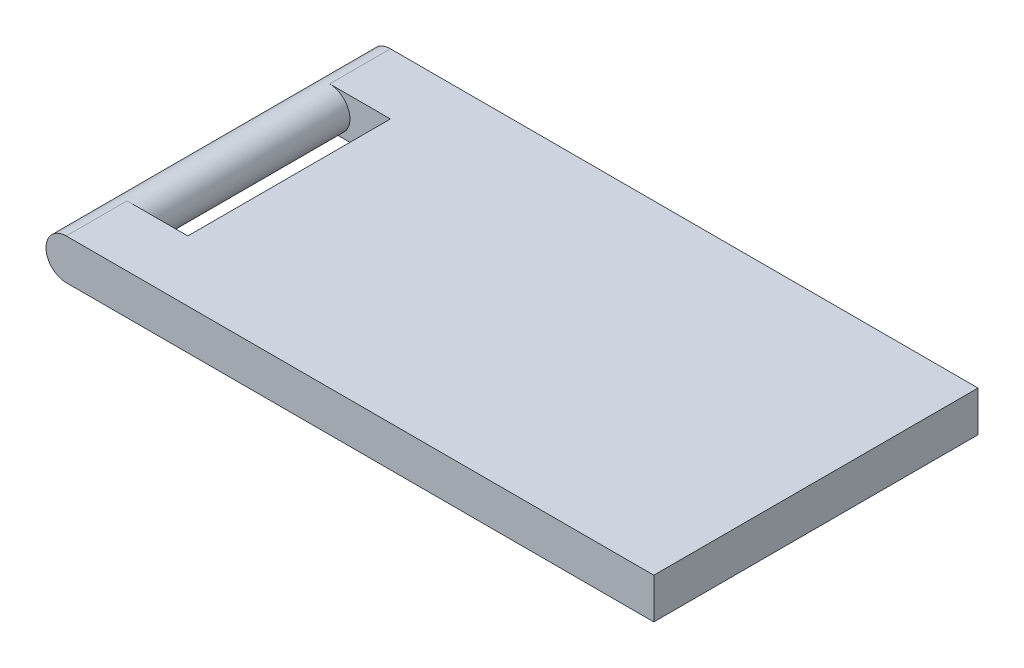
ISO-10303-21;
HEADER;
FILE_DESCRIPTION(('STEP AP214'),'2;1');
FILE_NAME('part.step','',(''),(''),'','','');
FILE_SCHEMA(('AUTOMOTIVE_DESIGN { 1 0 10303 214 1 1 1 1 }'));
ENDSEC;
DATA;
#1=APPLICATION_CONTEXT('core data for automotive mechanical design processes');
#2=APPLICATION_PROTOCOL_DEFINITION('international standard','automotive_design',2000,#1);
#3=PRODUCT_CONTEXT('',#1,'mechanical');
#4=PRODUCT('Part','Part','',(#3));
#5=PRODUCT_RELATED_PRODUCT_CATEGORY('part','',(#4));
#6=PRODUCT_DEFINITION_FORMATION('','',#4);
#7=PRODUCT_DEFINITION_CONTEXT('part definition',#1,'design');
#8=PRODUCT_DEFINITION('design','',#6,#7);
#9=PRODUCT_DEFINITION_SHAPE('','',#8);
#10=(LENGTH_UNIT() NAMED_UNIT(*) SI_UNIT(.MILLI.,.METRE.));
#11=(NAMED_UNIT(*) PLANE_ANGLE_UNIT() SI_UNIT($,.RADIAN.));
#12=(NAMED_UNIT(*) SI_UNIT($,.STERADIAN.) SOLID_ANGLE_UNIT());
#13=UNCERTAINTY_MEASURE_WITH_UNIT(LENGTH_MEASURE(1.E-05),#10,'distance_accuracy_value','');
#14=(GEOMETRIC_REPRESENTATION_CONTEXT(3) GLOBAL_UNCERTAINTY_ASSIGNED_CONTEXT((#13)) GLOBAL_UNIT_ASSIGNED_CONTEXT((#10,
#11,#12)) REPRESENTATION_CONTEXT('',''));
#15=CARTESIAN_POINT('',(0.,0.,0.));
#16=DIRECTION('',(0.,0.,1.));
#17=DIRECTION('',(1.,0.,0.));
#18=AXIS2_PLACEMENT_3D('',#15,#16,#17);
#19=CARTESIAN_POINT('',(0.,10.,-25.));
#20=DIRECTION('',(0.,0.,-1.));
#21=DIRECTION('',(-1.,0.,0.));
#22=AXIS2_PLACEMENT_3D('',#19,#20,#21);
#23=PLANE('',#22);
#24=CARTESIAN_POINT('',(5.00000000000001,5.,-25.));
#25=DIRECTION('',(0.,0.,1.));
#26=DIRECTION('',(1.,0.,0.));
#27=AXIS2_PLACEMENT_3D('',#24,#25,#26);
#28=CIRCLE('',#27,5.);
#29=CARTESIAN_POINT('',(5.00000000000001,0.,-25.));
#30=VERTEX_POINT('',#29);
#31=CARTESIAN_POINT('',(5.,10.,-25.));
#32=VERTEX_POINT('',#31);
#33=EDGE_CURVE('E105',#30,#32,#28,.T.);
#34=ORIENTED_EDGE('',*,*,#33,.F.);
#35=DIRECTION('',(1.,0.,0.));
#36=VECTOR('',#35,1.);
#37=CARTESIAN_POINT('',(0.,0.,-25.));
#38=LINE('',#37,#36);
#39=CARTESIAN_POINT('',(20.,0.,-25.));
#40=VERTEX_POINT('',#39);
#41=EDGE_CURVE('E92',#30,#40,#38,.T.);
#42=ORIENTED_EDGE('',*,*,#41,.T.);
#43=DIRECTION('',(0.,-1.,0.));
#44=VECTOR('',#43,1.);
#45=CARTESIAN_POINT('',(20.,10.,-25.));
#46=LINE('',#45,#44);
#47=CARTESIAN_POINT('',(20.,10.,-25.));
#48=VERTEX_POINT('',#47);
#49=EDGE_CURVE('E151',#48,#40,#46,.T.);
#50=ORIENTED_EDGE('',*,*,#49,.F.);
#51=DIRECTION('',(1.,0.,0.));
#52=VECTOR('',#51,1.);
#53=CARTESIAN_POINT('',(0.,10.,-25.));
#54=LINE('',#53,#52);
#55=EDGE_CURVE('E114',#32,#48,#54,.T.);
#56=ORIENTED_EDGE('',*,*,#55,.F.);
#57=EDGE_LOOP('',(#34,#42,#50,#56));
#58=FACE_BOUND('',#57,.T.);
#59=ADVANCED_FACE('F30',(#58),#23,.F.);
#60=CARTESIAN_POINT('',(0.,10.,25.));
#61=DIRECTION('',(0.,0.,1.));
#62=DIRECTION('',(1.,0.,0.));
#63=AXIS2_PLACEMENT_3D('',#60,#61,#62);
#64=PLANE('',#63);
#65=CARTESIAN_POINT('',(5.00000000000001,5.,25.));
#66=DIRECTION('',(0.,0.,1.));
#67=DIRECTION('',(1.,0.,0.));
#68=AXIS2_PLACEMENT_3D('',#65,#66,#67);
#69=CIRCLE('',#68,5.);
#70=CARTESIAN_POINT('',(5.00000000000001,10.,25.));
#71=VERTEX_POINT('',#70);
#72=CARTESIAN_POINT('',(5.00000000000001,0.,25.));
#73=VERTEX_POINT('',#72);
#74=EDGE_CURVE('E115',#71,#73,#69,.F.);
#75=ORIENTED_EDGE('',*,*,#74,.F.);
#76=DIRECTION('',(-1.,0.,0.));
#77=VECTOR('',#76,1.);
#78=CARTESIAN_POINT('',(0.,10.,25.));
#79=LINE('',#78,#77);
#80=CARTESIAN_POINT('',(20.,10.,25.));
#81=VERTEX_POINT('',#80);
#82=EDGE_CURVE('E124',#81,#71,#79,.T.);
#83=ORIENTED_EDGE('',*,*,#82,.F.);
#84=DIRECTION('',(0.,-1.,0.));
#85=VECTOR('',#84,1.);
#86=CARTESIAN_POINT('',(20.,10.,25.));
#87=LINE('',#86,#85);
#88=CARTESIAN_POINT('',(20.,0.,25.));
#89=VERTEX_POINT('',#88);
#90=EDGE_CURVE('E148',#81,#89,#87,.T.);
#91=ORIENTED_EDGE('',*,*,#90,.T.);
#92=DIRECTION('',(-1.,0.,0.));
#93=VECTOR('',#92,1.);
#94=CARTESIAN_POINT('',(0.,0.,25.));
#95=LINE('',#94,#93);
#96=EDGE_CURVE('E136',#89,#73,#95,.T.);
#97=ORIENTED_EDGE('',*,*,#96,.T.);
#98=EDGE_LOOP('',(#75,#83,#91,#97));
#99=FACE_BOUND('',#98,.T.);
#100=ADVANCED_FACE('F160',(#99),#64,.F.);
#101=CARTESIAN_POINT('',(5.,5.,-40.));
#102=DIRECTION('',(0.,0.,1.));
#103=DIRECTION('',(1.,0.,0.));
#104=AXIS2_PLACEMENT_3D('',#101,#102,#103);
#105=CYLINDRICAL_SURFACE('',#104,5.);
#106=DIRECTION('',(0.,0.,-1.));
#107=VECTOR('',#106,1.);
#108=CARTESIAN_POINT('',(5.,10.,-40.));
#109=LINE('',#108,#107);
#110=CARTESIAN_POINT('',(5.,10.,-40.));
#111=VERTEX_POINT('',#110);
#112=EDGE_CURVE('E111',#111,#32,#109,.F.);
#113=ORIENTED_EDGE('',*,*,#112,.F.);
#114=CARTESIAN_POINT('',(5.,5.,-40.));
#115=DIRECTION('',(0.,0.,1.));
#116=DIRECTION('',(1.,0.,0.));
#117=AXIS2_PLACEMENT_3D('',#114,#115,#116);
#118=CIRCLE('',#117,5.);
#119=CARTESIAN_POINT('',(5.,0.,-40.));
#120=VERTEX_POINT('',#119);
#121=EDGE_CURVE('E110',#120,#111,#118,.F.);
#122=ORIENTED_EDGE('',*,*,#121,.F.);
#123=DIRECTION('',(0.,0.,1.));
#124=VECTOR('',#123,1.);
#125=CARTESIAN_POINT('',(5.00000000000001,0.,-25.));
#126=LINE('',#125,#124);
#127=EDGE_CURVE('E97',#30,#120,#126,.F.);
#128=ORIENTED_EDGE('',*,*,#127,.F.);
#129=ORIENTED_EDGE('',*,*,#33,.T.);
#130=EDGE_LOOP('',(#113,#122,#128,#129));
#131=FACE_BOUND('',#130,.T.);
#132=DIRECTION('',(0.,0.,-1.));
#133=VECTOR('',#132,1.);
#134=CARTESIAN_POINT('',(5.00000000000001,10.,25.));
#135=LINE('',#134,#133);
#136=CARTESIAN_POINT('',(5.00000000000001,10.,40.));
#137=VERTEX_POINT('',#136);
#138=EDGE_CURVE('E155',#71,#137,#135,.F.);
#139=ORIENTED_EDGE('',*,*,#138,.F.);
#140=ORIENTED_EDGE('',*,*,#74,.T.);
#141=DIRECTION('',(0.,0.,1.));
#142=VECTOR('',#141,1.);
#143=CARTESIAN_POINT('',(5.,0.,-25.));
#144=LINE('',#143,#142);
#145=CARTESIAN_POINT('',(5.00000000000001,0.,40.));
#146=VERTEX_POINT('',#145);
#147=EDGE_CURVE('E38',#146,#73,#144,.F.);
#148=ORIENTED_EDGE('',*,*,#147,.F.);
#149=CARTESIAN_POINT('',(5.00000000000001,5.,40.));
#150=DIRECTION('',(0.,0.,-1.));
#151=DIRECTION('',(-1.,0.,0.));
#152=AXIS2_PLACEMENT_3D('',#149,#150,#151);
#153=CIRCLE('',#152,5.);
#154=EDGE_CURVE('E11',#137,#146,#153,.F.);
#155=ORIENTED_EDGE('',*,*,#154,.F.);
#156=EDGE_LOOP('',(#139,#140,#148,#155));
#157=FACE_BOUND('',#156,.T.);
#158=ADVANCED_FACE('F32',(#131,#157),#105,.T.);
#159=CARTESIAN_POINT('',(20.,10.,-25.));
#160=DIRECTION('',(1.,0.,0.));
#161=DIRECTION('',(0.,0.,-1.));
#162=AXIS2_PLACEMENT_3D('',#159,#160,#161);
#163=PLANE('',#162);
#164=DIRECTION('',(0.,0.,1.));
#165=VECTOR('',#164,1.);
#166=CARTESIAN_POINT('',(20.,0.,-25.));
#167=LINE('',#166,#165);
#168=EDGE_CURVE('E100',#40,#89,#167,.T.);
#169=ORIENTED_EDGE('',*,*,#168,.T.);
#170=ORIENTED_EDGE('',*,*,#90,.F.);
#171=DIRECTION('',(0.,0.,1.));
#172=VECTOR('',#171,1.);
#173=CARTESIAN_POINT('',(20.,10.,-25.));
#174=LINE('',#173,#172);
#175=EDGE_CURVE('E121',#48,#81,#174,.T.);
#176=ORIENTED_EDGE('',*,*,#175,.F.);
#177=ORIENTED_EDGE('',*,*,#49,.T.);
#178=EDGE_LOOP('',(#169,#170,#176,#177));
#179=FACE_BOUND('',#178,.T.);
#180=ADVANCED_FACE('F164',(#179),#163,.F.);
#181=CARTESIAN_POINT('',(0.,10.,40.));
#182=DIRECTION('',(0.,0.,-1.));
#183=DIRECTION('',(-1.,0.,0.));
#184=AXIS2_PLACEMENT_3D('',#181,#182,#183);
#185=PLANE('',#184);
#186=DIRECTION('',(1.,0.,0.));
#187=VECTOR('',#186,1.);
#188=CARTESIAN_POINT('',(0.,10.,40.));
#189=LINE('',#188,#187);
#190=CARTESIAN_POINT('',(150.,10.,40.));
#191=VERTEX_POINT('',#190);
#192=EDGE_CURVE('E127',#137,#191,#189,.T.);
#193=ORIENTED_EDGE('',*,*,#192,.F.);
#194=ORIENTED_EDGE('',*,*,#154,.T.);
#195=DIRECTION('',(1.,0.,0.));
#196=VECTOR('',#195,1.);
#197=CARTESIAN_POINT('',(0.,0.,40.));
#198=LINE('',#197,#196);
#199=CARTESIAN_POINT('',(150.,0.,40.));
#200=VERTEX_POINT('',#199);
#201=EDGE_CURVE('E138',#146,#200,#198,.T.);
#202=ORIENTED_EDGE('',*,*,#201,.T.);
#203=DIRECTION('',(0.,-1.,0.));
#204=VECTOR('',#203,1.);
#205=CARTESIAN_POINT('',(150.,10.,40.));
#206=LINE('',#205,#204);
#207=EDGE_CURVE('E145',#191,#200,#206,.T.);
#208=ORIENTED_EDGE('',*,*,#207,.F.);
#209=EDGE_LOOP('',(#193,#194,#202,#208));
#210=FACE_BOUND('',#209,.T.);
#211=ADVANCED_FACE('F175',(#210),#185,.F.);
#212=CARTESIAN_POINT('',(150.,10.,-40.));
#213=DIRECTION('',(-1.,0.,0.));
#214=DIRECTION('',(0.,0.,1.));
#215=AXIS2_PLACEMENT_3D('',#212,#213,#214);
#216=PLANE('',#215);
#217=DIRECTION('',(0.,0.,-1.));
#218=VECTOR('',#217,1.);
#219=CARTESIAN_POINT('',(150.,0.,-40.));
#220=LINE('',#219,#218);
#221=CARTESIAN_POINT('',(150.,0.,-40.));
#222=VERTEX_POINT('',#221);
#223=EDGE_CURVE('E140',#200,#222,#220,.T.);
#224=ORIENTED_EDGE('',*,*,#223,.T.);
#225=DIRECTION('',(0.,-1.,0.));
#226=VECTOR('',#225,1.);
#227=CARTESIAN_POINT('',(150.,10.,-40.));
#228=LINE('',#227,#226);
#229=CARTESIAN_POINT('',(150.,10.,-40.));
#230=VERTEX_POINT('',#229);
#231=EDGE_CURVE('E133',#230,#222,#228,.T.);
#232=ORIENTED_EDGE('',*,*,#231,.F.);
#233=DIRECTION('',(0.,0.,-1.));
#234=VECTOR('',#233,1.);
#235=CARTESIAN_POINT('',(150.,10.,-40.));
#236=LINE('',#235,#234);
#237=EDGE_CURVE('E129',#191,#230,#236,.T.);
#238=ORIENTED_EDGE('',*,*,#237,.F.);
#239=ORIENTED_EDGE('',*,*,#207,.T.);
#240=EDGE_LOOP('',(#224,#232,#238,#239));
#241=FACE_BOUND('',#240,.T.);
#242=ADVANCED_FACE('F173',(#241),#216,.F.);
#243=CARTESIAN_POINT('',(0.,10.,-40.));
#244=DIRECTION('',(0.,0.,1.));
#245=DIRECTION('',(1.,0.,0.));
#246=AXIS2_PLACEMENT_3D('',#243,#244,#245);
#247=PLANE('',#246);
#248=DIRECTION('',(-1.,0.,0.));
#249=VECTOR('',#248,1.);
#250=CARTESIAN_POINT('',(0.,0.,-40.));
#251=LINE('',#250,#249);
#252=EDGE_CURVE('E122',#222,#120,#251,.T.);
#253=ORIENTED_EDGE('',*,*,#252,.T.);
#254=ORIENTED_EDGE('',*,*,#121,.T.);
#255=DIRECTION('',(-1.,0.,0.));
#256=VECTOR('',#255,1.);
#257=CARTESIAN_POINT('',(0.,10.,-40.));
#258=LINE('',#257,#256);
#259=EDGE_CURVE('E131',#230,#111,#258,.T.);
#260=ORIENTED_EDGE('',*,*,#259,.F.);
#261=ORIENTED_EDGE('',*,*,#231,.T.);
#262=EDGE_LOOP('',(#253,#254,#260,#261));
#263=FACE_BOUND('',#262,.T.);
#264=ADVANCED_FACE('F171',(#263),#247,.F.);
#265=CARTESIAN_POINT('',(0.,10.,-25.));
#266=DIRECTION('',(0.,1.,0.));
#267=DIRECTION('',(0.,0.,1.));
#268=AXIS2_PLACEMENT_3D('',#265,#266,#267);
#269=PLANE('',#268);
#270=ORIENTED_EDGE('',*,*,#82,.T.);
#271=ORIENTED_EDGE('',*,*,#138,.T.);
#272=ORIENTED_EDGE('',*,*,#192,.T.);
#273=ORIENTED_EDGE('',*,*,#237,.T.);
#274=ORIENTED_EDGE('',*,*,#259,.T.);
#275=ORIENTED_EDGE('',*,*,#112,.T.);
#276=ORIENTED_EDGE('',*,*,#55,.T.);
#277=ORIENTED_EDGE('',*,*,#175,.T.);
#278=EDGE_LOOP('',(#270,#271,#272,#273,#274,#275,#276,#277));
#279=FACE_BOUND('',#278,.T.);
#280=ADVANCED_FACE('F166',(#279),#269,.T.);
#281=CARTESIAN_POINT('',(0.,0.,-25.));
#282=DIRECTION('',(0.,1.,0.));
#283=DIRECTION('',(0.,0.,1.));
#284=AXIS2_PLACEMENT_3D('',#281,#282,#283);
#285=PLANE('',#284);
#286=ORIENTED_EDGE('',*,*,#201,.F.);
#287=ORIENTED_EDGE('',*,*,#147,.T.);
#288=ORIENTED_EDGE('',*,*,#96,.F.);
#289=ORIENTED_EDGE('',*,*,#168,.F.);
#290=ORIENTED_EDGE('',*,*,#41,.F.);
#291=ORIENTED_EDGE('',*,*,#127,.T.);
#292=ORIENTED_EDGE('',*,*,#252,.F.);
#293=ORIENTED_EDGE('',*,*,#223,.F.);
#294=EDGE_LOOP('',(#286,#287,#288,#289,#290,#291,#292,#293));
#295=FACE_BOUND('',#294,.T.);
#296=ADVANCED_FACE('F95',(#295),#285,.F.);
#297=CLOSED_SHELL('',(#59,#100,#158,#180,#211,#242,#264,#280,#296));
#298=MANIFOLD_SOLID_BREP('B2',#297);
#299=ADVANCED_BREP_SHAPE_REPRESENTATION('',(#18,#298),#14);
#300=SHAPE_DEFINITION_REPRESENTATION(#9,#299);
ENDSEC;
END-ISO-10303-21;
